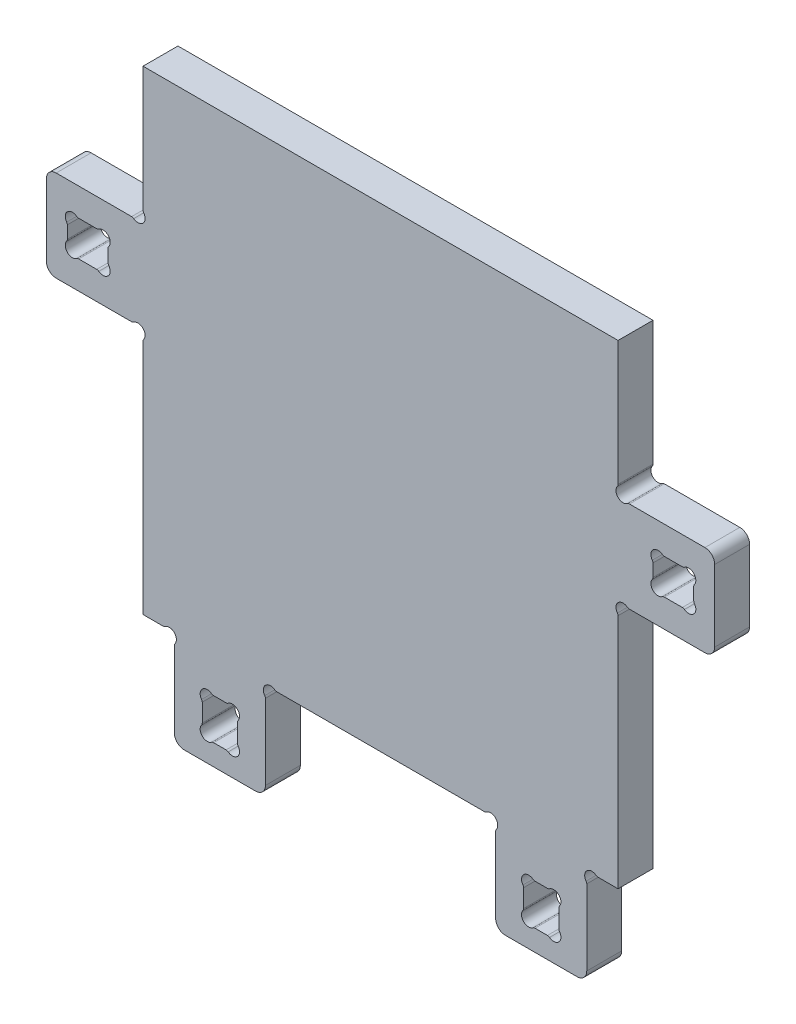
from build123d import *

# Parameters (mm, degrees)
BOSS_EXTRU_2_DEPTH = 25
CONG_1_R           = 7


with BuildPart() as part:
    # Esquisse2 → Boss.-Extru.2 (new body)
    with BuildSketch(Plane.XY):
        with BuildLine():
            Line((0, 0), (65.2, 0))
            Line((65.2, 0), (65.2, 61.035626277))
            ThreePointArc((65.2, 61.035626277), (65.073982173, 61.81934092), (64.708633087, 62.52404595))
            ThreePointArc((64.708633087, 62.52404595), (65.2, 69.166666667), (71.842620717, 69.65803358))
            ThreePointArc((71.842620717, 69.65803358), (72.547325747, 69.292684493), (73.331040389, 69.166666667))
            Line((73.331040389, 69.166666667), (147.6, 69.166666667))
            Line((147.6, 69.166666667), (147.6, 409.066666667))
            Line((147.6, 409.066666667), (-22.4, 409.066666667))
            Line((-22.4, 409.066666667), (-22.4, 319.897707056))
            ThreePointArc((-22.4, 319.897707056), (-22.273982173, 319.113992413), (-21.908633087, 318.409287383))
            ThreePointArc((-21.908633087, 318.409287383), (-22.4, 311.766666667), (-29.042620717, 311.275299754))
            ThreePointArc((-29.042620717, 311.275299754), (-29.747325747, 311.64064884), (-30.531040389, 311.766666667))
            Line((-30.531040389, 311.766666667), (-91.566666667, 311.766666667))
            Line((-91.566666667, 311.766666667), (-91.566666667, 246.566666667))
            Line((-91.566666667, 246.566666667), (-30.531040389, 246.566666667))
            ThreePointArc((-30.531040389, 246.566666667), (-29.747325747, 246.692684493), (-29.042620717, 247.05803358))
            ThreePointArc((-29.042620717, 247.05803358), (-22.4, 246.566666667), (-21.908633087, 239.92404595))
            ThreePointArc((-21.908633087, 239.92404595), (-22.273982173, 239.21934092), (-22.4, 238.435626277))
            Line((-22.4, 238.435626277), (-22.4, 69.166666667))
            Line((-22.4, 69.166666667), (-8.131040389, 69.166666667))
            ThreePointArc((-8.131040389, 69.166666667), (-7.347325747, 69.292684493), (-6.642620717, 69.65803358))
            ThreePointArc((-6.642620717, 69.65803358), (0, 69.166666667), (0.491366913, 62.52404595))
            ThreePointArc((0.491366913, 62.52404595), (0.126017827, 61.81934092), (0, 61.035626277))
            Line((0, 61.035626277), (0, 0))
        make_face()
        with BuildLine():
            Line((45.2, 36.035626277), (45.2, 23.131040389))
            ThreePointArc((45.2, 23.131040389), (45.326017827, 22.347325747), (45.691366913, 21.642620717))
            ThreePointArc((45.691366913, 21.642620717), (45.2, 15), (38.557379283, 14.508633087))
            ThreePointArc((38.557379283, 14.508633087), (37.852674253, 14.873982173), (37.068959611, 15))
            Line((37.068959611, 15), (28.131040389, 15))
            ThreePointArc((28.131040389, 15), (27.347325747, 14.873982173), (26.642620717, 14.508633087))
            ThreePointArc((26.642620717, 14.508633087), (20, 15), (19.508633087, 21.642620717))
            ThreePointArc((19.508633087, 21.642620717), (19.873982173, 22.347325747), (20, 23.131040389))
            Line((20, 23.131040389), (20, 36.035626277))
            ThreePointArc((20, 36.035626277), (19.873982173, 36.81934092), (19.508633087, 37.52404595))
            ThreePointArc((19.508633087, 37.52404595), (20, 44.166666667), (26.642620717, 44.65803358))
            ThreePointArc((26.642620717, 44.65803358), (27.347325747, 44.292684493), (28.131040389, 44.166666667))
            Line((28.131040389, 44.166666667), (37.068959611, 44.166666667))
            ThreePointArc((37.068959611, 44.166666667), (37.852674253, 44.292684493), (38.557379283, 44.65803358))
            ThreePointArc((38.557379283, 44.65803358), (45.2, 44.166666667), (45.691366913, 37.52404595))
            ThreePointArc((45.691366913, 37.52404595), (45.326017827, 36.81934092), (45.2, 36.035626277))
        make_face(mode=Mode.SUBTRACT)
        with BuildLine():
            Line((-55.531040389, 266.566666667), (-68.435626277, 266.566666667))
            ThreePointArc((-68.435626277, 266.566666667), (-69.21934092, 266.44064884), (-69.92404595, 266.075299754))
            ThreePointArc((-69.92404595, 266.075299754), (-76.566666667, 266.566666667), (-77.05803358, 273.209287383))
            ThreePointArc((-77.05803358, 273.209287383), (-76.692684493, 273.913992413), (-76.566666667, 274.697707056))
            Line((-76.566666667, 274.697707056), (-76.566666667, 283.635626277))
            ThreePointArc((-76.566666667, 283.635626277), (-76.692684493, 284.41934092), (-77.05803358, 285.12404595))
            ThreePointArc((-77.05803358, 285.12404595), (-76.566666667, 291.766666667), (-69.92404595, 292.25803358))
            ThreePointArc((-69.92404595, 292.25803358), (-69.21934092, 291.892684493), (-68.435626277, 291.766666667))
            Line((-68.435626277, 291.766666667), (-55.531040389, 291.766666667))
            ThreePointArc((-55.531040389, 291.766666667), (-54.747325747, 291.892684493), (-54.042620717, 292.25803358))
            ThreePointArc((-54.042620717, 292.25803358), (-47.4, 291.766666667), (-46.908633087, 285.12404595))
            ThreePointArc((-46.908633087, 285.12404595), (-47.273982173, 284.41934092), (-47.4, 283.635626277))
            Line((-47.4, 283.635626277), (-47.4, 274.697707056))
            ThreePointArc((-47.4, 274.697707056), (-47.273982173, 273.913992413), (-46.908633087, 273.209287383))
            ThreePointArc((-46.908633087, 273.209287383), (-47.4, 266.566666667), (-54.042620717, 266.075299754))
            ThreePointArc((-54.042620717, 266.075299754), (-54.747325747, 266.44064884), (-55.531040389, 266.566666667))
        make_face(mode=Mode.SUBTRACT)
    extrude(amount=BOSS_EXTRU_2_DEPTH)

    # Cong_1
    cong_1_edges = [part.edges().sort_by_distance(p)[0] for p in [
        (-91.566666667, 246.566666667, 12.5),
        (-91.566666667, 311.766666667, 12.5),
        (65.2, 0, 12.5),
        (0, 0, 12.5),
    ]]
    fillet(cong_1_edges, radius=CONG_1_R)

    # Mirror2: part across plane


with BuildPart() as part_1:
    add(part.part)
    add(part.part.mirror(Plane(origin=(147.6, 409.066666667, 25), x_dir=(0, 0, 1), z_dir=(-1, 0, 0))))


solid = part_1.part
